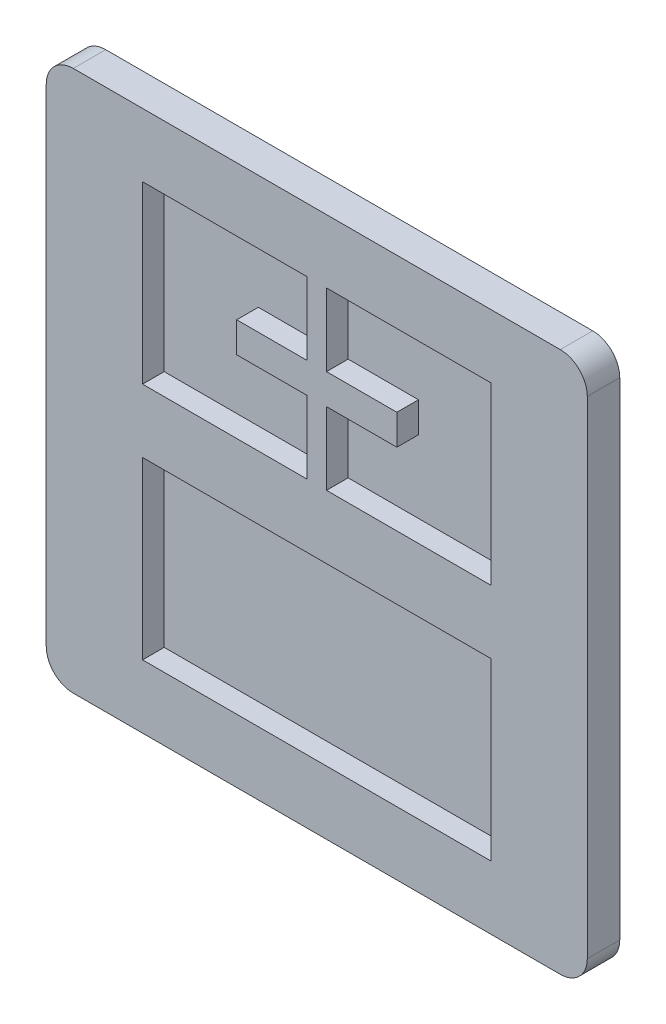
from build123d import *

# Parameters (mm, degrees)
SKIZZE2_W                       = 100
SKIZZE2_H                       = 100
AUFSATZ_LINEAR_AUSTRAGEN1_DEPTH = 2
SKIZZE3_W                       = 100
SKIZZE3_H                       = 100
SKIZZE3_W_2                     = 64.4
SKIZZE3_H_2                     = 32.4
AUFSATZ_LINEAR_AUSTRAGEN2_DEPTH = 4
VERRUNDUNG1_R                   = 5


with BuildPart() as part:
    # Skizze2 → Aufsatz-Linear austragen1 (new body)
    with BuildSketch(Plane.XY):
        Rectangle(SKIZZE2_W, SKIZZE2_H)
    extrude(amount=AUFSATZ_LINEAR_AUSTRAGEN1_DEPTH)

    # Skizze3 → Aufsatz-Linear austragen2 (add)
    with BuildSketch(Plane.XY.offset(2)):
        Rectangle(SKIZZE3_W, SKIZZE3_H)
        with Locations((0, -22.066666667)):
            Rectangle(SKIZZE3_W_2, SKIZZE3_H_2, mode=Mode.SUBTRACT)
        Polygon((-1.8, 19.266666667), (-14.8, 19.266666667), (-14.8, 24.866666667), (-1.8, 24.866666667), (-1.8, 38.266666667), (-32.2, 38.266666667), (-32.2, 5.866666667), (-1.8, 5.866666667), align=None, mode=Mode.SUBTRACT)
        Polygon((32.2, 5.866666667), (1.8, 5.866666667), (1.8, 19.266666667), (14.8, 19.266666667), (14.8, 24.866666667), (1.8, 24.866666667), (1.8, 38.266666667), (32.2, 38.266666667), align=None, mode=Mode.SUBTRACT)
    extrude(amount=AUFSATZ_LINEAR_AUSTRAGEN2_DEPTH)

    # Verrundung1
    verrundung1_edges = [part.edges().sort_by_distance(p)[0] for p in [
        (50, -50, 3),
        (-50, -50, 3),
        (-50, 50, 3),
        (50, 50, 3),
    ]]
    fillet(verrundung1_edges, radius=VERRUNDUNG1_R)


solid = part.part
